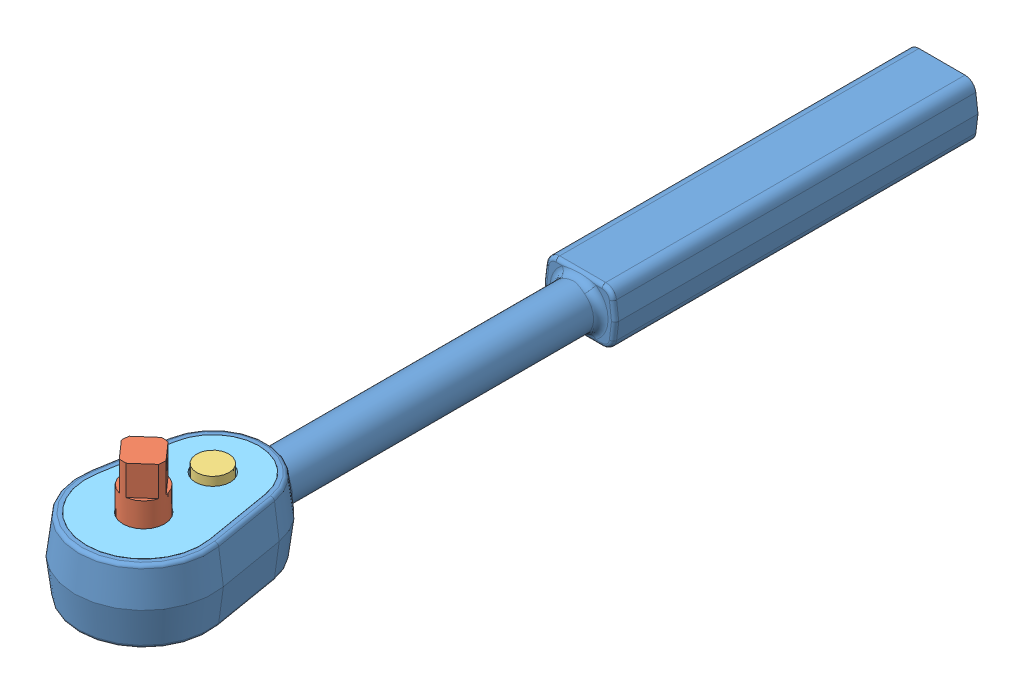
SolidWorks assembly Ratchet Assembly.sldasm, configuration Default (file format 13000). Lengths in mm.
Overall size (38.1 39.29 239.05).
5 component instances, 5 part files, 11 mates.
Components (placement in the parent):
- Main Body-1: Main Body.sldprt [Default] at (4.5281 23.1839 102) size (38.1 20 239.05)
- Wheel-1: Wheel.sldprt [Default] at (4.5281 18.1839 102) x (-0.66172 0 -0.749751) z (0.749751 0 -0.66172) size (24.13 36.12 24.13)
- Ratchet-1: Ratchet.sldprt [Default] at (4.5281 18.1839 82.95) x (0.785799 0 -0.618483) z (0.618483 0 0.785799) size (19.05 26.67 15.46)
- Lever-1: Lever.sldprt [Default] at (4.5281 8.6589 82.95) x (0.618483 0 0.785799) z (-0.785799 0 0.618483) size (22.22 3.17 9.53)
- Cover Plate-1: Cover Plate.SLDPRT [Default] at (4.5281 31.1839 102) x (-1 0 0) z (0 1 0) size (31.64 47.52 2.03)
Mates (geometry in assembly coordinates):
- Concentric1: concentric: cylinder of Main Body-1 through (4.5281 18.1839 102) axis (0 1 0) radius 12.7; cylinder of Wheel-1 through (4.5281 11.8339 102) axis (0 1 0) radius 5.5563
- Coincident1: coincident: plane of Main Body-1 through (4.5281 18.1839 92.475) normal (0 1 0); plane of Wheel-1 through (4.5281 18.1839 102) normal (0 -1 0)
- Concentric2: concentric: cylinder of Main Body-1 through (4.5281 18.1839 82.95) axis (0 1 0) radius 10.16; cylinder of Ratchet-1 through (4.5281 30.2489 82.95) axis (0 -1 0) radius 4.445
- Coincident2: coincident: plane of Main Body-1 through (4.5281 18.1839 92.475) normal (0 1 0); plane of Ratchet-1 through (4.5281 18.1839 82.95) normal (0 -1 0)
- Coincident3: coincident: plane of Ratchet-1 through (5.2443 8.6589 86.4268) normal (-0.785799 0 0.618483); plane of Lever-1 through (1.317 8.6589 81.4369) normal (0.785799 0 -0.618483)
- Coincident5: coincident: plane of Ratchet-1 through (4.5281 11.8339 82.95) normal (0 -1 0); plane of Lever-1 through (4.5281 11.8339 82.95) normal (0 1 0)
- Coincident6: coincident: plane of Ratchet-1 through (5.2443 8.6589 86.4268) normal (0.618483 0 0.785799); plane of Lever-1 through (5.2443 8.6589 86.4268) normal (-0.618483 0 -0.785799)
- Inplace1: in place: plane of Main Body-1 through (4.5281 31.1839 102) normal (0 1 0); plane of Cover Plate-1; moOrthogonalPlaneRef_w of Main Body-1; plane of Cover Plate-1; moOrthogonalPlaneRef_w of Main Body-1; plane of Cover Plate-1
- Coincident7: coincident: plane of Main Body-1; plane of Cover Plate-1
- Coincident8: coincident: moOrthogonalPlaneRef_w of Main Body-1 through (4.5281 31.1839 102) axis (0 0 1); plane of Cover Plate-1
- Coincident9: coincident: moOrthogonalPlaneRef_w of Main Body-1 through (4.5281 31.1839 102) axis (1 0 0); plane of Cover Plate-1
